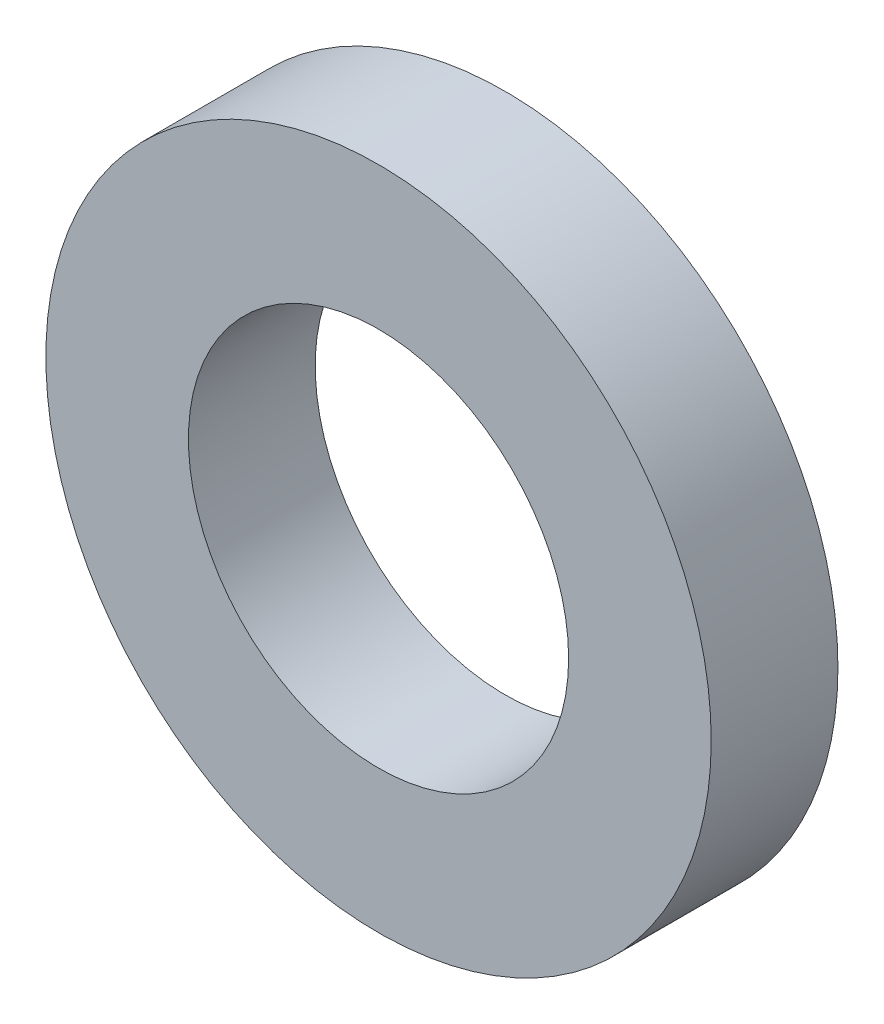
from build123d import *

# Parameters (mm, degrees)
SKETCH1_R           = 5.75
SKETCH1_R_2         = 4
BOSS_EXTRUDE1_DEPTH = 2
MOVE_FACE1_BY       = 0.5
MOVE_FACE2_BY       = 1


with BuildPart() as part:
    # Sketch1 → Boss-Extrude1 (new body)
    with BuildSketch(Plane.XY):
        Circle(SKETCH1_R)
        Circle(SKETCH1_R_2, mode=Mode.SUBTRACT)
    extrude(amount=BOSS_EXTRUDE1_DEPTH)

    # Move Face1: a curved face moved inward by 0.5
    add(Solid.thicken(part.faces().sort_by_distance((-5.75, 0, 1))[0], -MOVE_FACE1_BY), mode=Mode.SUBTRACT)

    # Move Face2: a curved face moved outward by 1.0
    add(Solid.thicken(part.faces().sort_by_distance((-4, 0, 1))[0], MOVE_FACE2_BY))


solid = part.part
